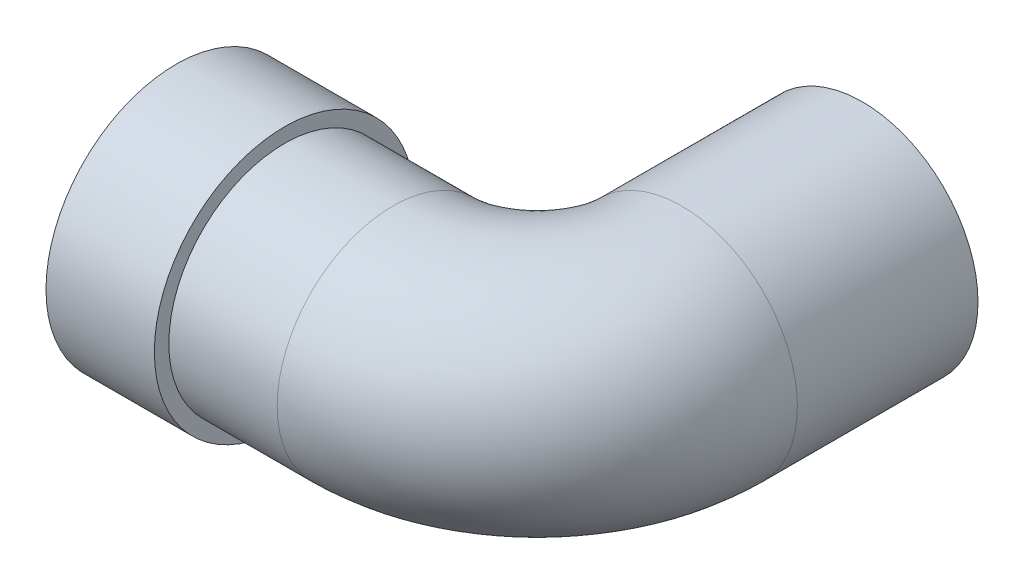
ISO-10303-21;
HEADER;
FILE_DESCRIPTION(('STEP AP214'),'2;1');
FILE_NAME('part.step','',(''),(''),'','','');
FILE_SCHEMA(('AUTOMOTIVE_DESIGN { 1 0 10303 214 1 1 1 1 }'));
ENDSEC;
DATA;
#1=APPLICATION_CONTEXT('core data for automotive mechanical design processes');
#2=APPLICATION_PROTOCOL_DEFINITION('international standard','automotive_design',2000,#1);
#3=PRODUCT_CONTEXT('',#1,'mechanical');
#4=PRODUCT('Part','Part','',(#3));
#5=PRODUCT_RELATED_PRODUCT_CATEGORY('part','',(#4));
#6=PRODUCT_DEFINITION_FORMATION('','',#4);
#7=PRODUCT_DEFINITION_CONTEXT('part definition',#1,'design');
#8=PRODUCT_DEFINITION('design','',#6,#7);
#9=PRODUCT_DEFINITION_SHAPE('','',#8);
#10=(LENGTH_UNIT() NAMED_UNIT(*) SI_UNIT(.MILLI.,.METRE.));
#11=(NAMED_UNIT(*) PLANE_ANGLE_UNIT() SI_UNIT($,.RADIAN.));
#12=(NAMED_UNIT(*) SI_UNIT($,.STERADIAN.) SOLID_ANGLE_UNIT());
#13=UNCERTAINTY_MEASURE_WITH_UNIT(LENGTH_MEASURE(1.E-05),#10,'distance_accuracy_value','');
#14=(GEOMETRIC_REPRESENTATION_CONTEXT(3) GLOBAL_UNCERTAINTY_ASSIGNED_CONTEXT((#13)) GLOBAL_UNIT_ASSIGNED_CONTEXT((#10,
#11,#12)) REPRESENTATION_CONTEXT('',''));
#15=CARTESIAN_POINT('',(0.,0.,0.));
#16=DIRECTION('',(0.,0.,1.));
#17=DIRECTION('',(1.,0.,0.));
#18=AXIS2_PLACEMENT_3D('',#15,#16,#17);
#19=CARTESIAN_POINT('',(-20.,0.,45.));
#20=DIRECTION('',(-1.,0.,0.));
#21=DIRECTION('',(0.,0.,1.));
#22=AXIS2_PLACEMENT_3D('',#19,#20,#21);
#23=CYLINDRICAL_SURFACE('',#22,16.);
#24=CARTESIAN_POINT('',(-20.,0.,45.));
#25=DIRECTION('',(-1.,0.,0.));
#26=DIRECTION('',(0.,0.,1.));
#27=AXIS2_PLACEMENT_3D('',#24,#25,#26);
#28=CIRCLE('',#27,16.);
#29=CARTESIAN_POINT('',(-20.,0.,61.));
#30=VERTEX_POINT('',#29);
#31=EDGE_CURVE('E40',#30,#30,#28,.T.);
#32=ORIENTED_EDGE('',*,*,#31,.T.);
#33=EDGE_LOOP('',(#32));
#34=FACE_BOUND('',#33,.T.);
#35=CARTESIAN_POINT('',(-35.,0.,45.));
#36=DIRECTION('',(-1.,0.,0.));
#37=DIRECTION('',(0.,0.,1.));
#38=AXIS2_PLACEMENT_3D('',#35,#36,#37);
#39=CIRCLE('',#38,16.);
#40=CARTESIAN_POINT('',(-35.,0.,61.));
#41=VERTEX_POINT('',#40);
#42=EDGE_CURVE('E68',#41,#41,#39,.T.);
#43=ORIENTED_EDGE('',*,*,#42,.F.);
#44=EDGE_LOOP('',(#43));
#45=FACE_BOUND('',#44,.T.);
#46=ADVANCED_FACE('F37',(#34,#45),#23,.T.);
#47=CARTESIAN_POINT('',(0.,0.,0.));
#48=DIRECTION('',(0.,0.,1.));
#49=DIRECTION('',(1.,0.,0.));
#50=AXIS2_PLACEMENT_3D('',#47,#48,#49);
#51=CYLINDRICAL_SURFACE('',#50,16.);
#52=CARTESIAN_POINT('',(0.,0.,25.));
#53=DIRECTION('',(0.,0.,1.));
#54=DIRECTION('',(1.,0.,0.));
#55=AXIS2_PLACEMENT_3D('',#52,#53,#54);
#56=CIRCLE('',#55,16.);
#57=CARTESIAN_POINT('',(16.,0.,25.));
#58=VERTEX_POINT('',#57);
#59=EDGE_CURVE('E56',#58,#58,#56,.T.);
#60=ORIENTED_EDGE('',*,*,#59,.F.);
#61=EDGE_LOOP('',(#60));
#62=FACE_BOUND('',#61,.T.);
#63=CARTESIAN_POINT('',(0.,0.,0.));
#64=DIRECTION('',(0.,0.,1.));
#65=DIRECTION('',(1.,0.,0.));
#66=AXIS2_PLACEMENT_3D('',#63,#64,#65);
#67=CIRCLE('',#66,16.);
#68=CARTESIAN_POINT('',(16.,0.,0.));
#69=VERTEX_POINT('',#68);
#70=EDGE_CURVE('E53',#69,#69,#67,.T.);
#71=ORIENTED_EDGE('',*,*,#70,.T.);
#72=EDGE_LOOP('',(#71));
#73=FACE_BOUND('',#72,.T.);
#74=ADVANCED_FACE('F92',(#62,#73),#51,.T.);
#75=CARTESIAN_POINT('',(-20.,0.,25.));
#76=DIRECTION('',(0.,-1.,0.));
#77=DIRECTION('',(0.,0.,-1.));
#78=AXIS2_PLACEMENT_3D('',#75,#76,#77);
#79=TOROIDAL_SURFACE('',#78,20.,16.);
#80=CARTESIAN_POINT('',(-20.,0.,25.));
#81=DIRECTION('',(0.,-1.,0.));
#82=DIRECTION('',(0.,0.,-1.));
#83=AXIS2_PLACEMENT_3D('',#80,#81,#82);
#84=CIRCLE('',#83,36.);
#85=EDGE_CURVE('',#58,#30,#84,.T.);
#86=ORIENTED_EDGE('',*,*,#59,.T.);
#87=ORIENTED_EDGE('',*,*,#31,.F.);
#88=ORIENTED_EDGE('',*,*,#85,.T.);
#89=ORIENTED_EDGE('',*,*,#85,.F.);
#90=EDGE_LOOP('',(#86,#88,#87,#89));
#91=FACE_BOUND('',#90,.T.);
#92=ADVANCED_FACE('F88',(#91),#79,.T.);
#93=CARTESIAN_POINT('',(0.,0.,0.));
#94=DIRECTION('',(0.,0.,1.));
#95=DIRECTION('',(1.,0.,0.));
#96=AXIS2_PLACEMENT_3D('',#93,#94,#95);
#97=PLANE('',#96);
#98=CARTESIAN_POINT('',(0.,0.,0.));
#99=DIRECTION('',(0.,0.,1.));
#100=DIRECTION('',(1.,0.,0.));
#101=AXIS2_PLACEMENT_3D('',#98,#99,#100);
#102=CIRCLE('',#101,14.);
#103=CARTESIAN_POINT('',(14.,0.,0.));
#104=VERTEX_POINT('',#103);
#105=EDGE_CURVE('E55',#104,#104,#102,.F.);
#106=ORIENTED_EDGE('',*,*,#105,.F.);
#107=EDGE_LOOP('',(#106));
#108=FACE_BOUND('',#107,.T.);
#109=ORIENTED_EDGE('',*,*,#70,.F.);
#110=EDGE_LOOP('',(#109));
#111=FACE_BOUND('',#110,.T.);
#112=ADVANCED_FACE('F85',(#108,#111),#97,.F.);
#113=CARTESIAN_POINT('',(-40.,0.,45.));
#114=DIRECTION('',(-1.,0.,0.));
#115=DIRECTION('',(0.,0.,1.));
#116=AXIS2_PLACEMENT_3D('',#113,#114,#115);
#117=PLANE('',#116);
#118=CARTESIAN_POINT('',(-40.,0.,45.));
#119=DIRECTION('',(-1.,0.,0.));
#120=DIRECTION('',(0.,0.,1.));
#121=AXIS2_PLACEMENT_3D('',#118,#119,#120);
#122=CIRCLE('',#121,14.);
#123=CARTESIAN_POINT('',(-40.,0.,59.));
#124=VERTEX_POINT('',#123);
#125=EDGE_CURVE('E10',#124,#124,#122,.F.);
#126=ORIENTED_EDGE('',*,*,#125,.T.);
#127=EDGE_LOOP('',(#126));
#128=FACE_BOUND('',#127,.T.);
#129=CARTESIAN_POINT('',(-40.,0.,45.));
#130=DIRECTION('',(-1.,0.,0.));
#131=DIRECTION('',(0.,0.,1.));
#132=AXIS2_PLACEMENT_3D('',#129,#130,#131);
#133=CIRCLE('',#132,16.);
#134=CARTESIAN_POINT('',(-40.,0.,61.));
#135=VERTEX_POINT('',#134);
#136=EDGE_CURVE('E58',#135,#135,#133,.T.);
#137=ORIENTED_EDGE('',*,*,#136,.T.);
#138=EDGE_LOOP('',(#137));
#139=FACE_BOUND('',#138,.T.);
#140=ADVANCED_FACE('F81',(#128,#139),#117,.T.);
#141=CARTESIAN_POINT('',(0.,0.,0.));
#142=DIRECTION('',(0.,0.,1.));
#143=DIRECTION('',(1.,0.,0.));
#144=AXIS2_PLACEMENT_3D('',#141,#142,#143);
#145=CYLINDRICAL_SURFACE('',#144,14.);
#146=CARTESIAN_POINT('',(0.,0.,25.));
#147=DIRECTION('',(0.,0.,1.));
#148=DIRECTION('',(1.,0.,0.));
#149=AXIS2_PLACEMENT_3D('',#146,#147,#148);
#150=CIRCLE('',#149,14.);
#151=CARTESIAN_POINT('',(14.,0.,25.));
#152=VERTEX_POINT('',#151);
#153=EDGE_CURVE('E49',#152,#152,#150,.F.);
#154=ORIENTED_EDGE('',*,*,#153,.F.);
#155=EDGE_LOOP('',(#154));
#156=FACE_BOUND('',#155,.T.);
#157=ORIENTED_EDGE('',*,*,#105,.T.);
#158=EDGE_LOOP('',(#157));
#159=FACE_BOUND('',#158,.T.);
#160=ADVANCED_FACE('F78',(#156,#159),#145,.F.);
#161=CARTESIAN_POINT('',(-20.,0.,25.));
#162=DIRECTION('',(0.,-1.,0.));
#163=DIRECTION('',(0.,0.,-1.));
#164=AXIS2_PLACEMENT_3D('',#161,#162,#163);
#165=TOROIDAL_SURFACE('',#164,20.,14.);
#166=CARTESIAN_POINT('',(-20.,0.,45.));
#167=DIRECTION('',(-1.,0.,0.));
#168=DIRECTION('',(0.,0.,1.));
#169=AXIS2_PLACEMENT_3D('',#166,#167,#168);
#170=CIRCLE('',#169,14.);
#171=CARTESIAN_POINT('',(-20.,0.,59.));
#172=VERTEX_POINT('',#171);
#173=EDGE_CURVE('E44',#172,#172,#170,.F.);
#174=CARTESIAN_POINT('',(-20.,0.,25.));
#175=DIRECTION('',(0.,-1.,0.));
#176=DIRECTION('',(0.,0.,-1.));
#177=AXIS2_PLACEMENT_3D('',#174,#175,#176);
#178=CIRCLE('',#177,34.);
#179=EDGE_CURVE('',#152,#172,#178,.T.);
#180=ORIENTED_EDGE('',*,*,#153,.T.);
#181=ORIENTED_EDGE('',*,*,#173,.F.);
#182=ORIENTED_EDGE('',*,*,#179,.T.);
#183=ORIENTED_EDGE('',*,*,#179,.F.);
#184=EDGE_LOOP('',(#180,#182,#181,#183));
#185=FACE_BOUND('',#184,.T.);
#186=ADVANCED_FACE('F76',(#185),#165,.F.);
#187=CARTESIAN_POINT('',(-20.,0.,45.));
#188=DIRECTION('',(-1.,0.,0.));
#189=DIRECTION('',(0.,0.,1.));
#190=AXIS2_PLACEMENT_3D('',#187,#188,#189);
#191=CYLINDRICAL_SURFACE('',#190,14.);
#192=ORIENTED_EDGE('',*,*,#125,.F.);
#193=EDGE_LOOP('',(#192));
#194=FACE_BOUND('',#193,.T.);
#195=ORIENTED_EDGE('',*,*,#173,.T.);
#196=EDGE_LOOP('',(#195));
#197=FACE_BOUND('',#196,.T.);
#198=ADVANCED_FACE('F103',(#194,#197),#191,.F.);
#199=CARTESIAN_POINT('',(-35.,0.,45.));
#200=DIRECTION('',(-1.,0.,0.));
#201=DIRECTION('',(0.,0.,1.));
#202=AXIS2_PLACEMENT_3D('',#199,#200,#201);
#203=CYLINDRICAL_SURFACE('',#202,18.);
#204=CARTESIAN_POINT('',(-35.,0.,45.));
#205=DIRECTION('',(-1.,0.,0.));
#206=DIRECTION('',(0.,0.,1.));
#207=AXIS2_PLACEMENT_3D('',#204,#205,#206);
#208=CIRCLE('',#207,18.);
#209=CARTESIAN_POINT('',(-35.,0.,63.));
#210=VERTEX_POINT('',#209);
#211=EDGE_CURVE('E63',#210,#210,#208,.T.);
#212=ORIENTED_EDGE('',*,*,#211,.T.);
#213=EDGE_LOOP('',(#212));
#214=FACE_BOUND('',#213,.T.);
#215=CARTESIAN_POINT('',(-50.,0.,45.));
#216=DIRECTION('',(-1.,0.,0.));
#217=DIRECTION('',(0.,0.,1.));
#218=AXIS2_PLACEMENT_3D('',#215,#216,#217);
#219=CIRCLE('',#218,18.);
#220=CARTESIAN_POINT('',(-50.,0.,63.));
#221=VERTEX_POINT('',#220);
#222=EDGE_CURVE('E184',#221,#221,#219,.T.);
#223=ORIENTED_EDGE('',*,*,#222,.F.);
#224=EDGE_LOOP('',(#223));
#225=FACE_BOUND('',#224,.T.);
#226=ADVANCED_FACE('F96',(#214,#225),#203,.T.);
#227=CARTESIAN_POINT('',(-35.,0.,45.));
#228=DIRECTION('',(-1.,0.,0.));
#229=DIRECTION('',(0.,0.,1.));
#230=AXIS2_PLACEMENT_3D('',#227,#228,#229);
#231=PLANE('',#230);
#232=ORIENTED_EDGE('',*,*,#42,.T.);
#233=EDGE_LOOP('',(#232));
#234=FACE_BOUND('',#233,.T.);
#235=ORIENTED_EDGE('',*,*,#211,.F.);
#236=EDGE_LOOP('',(#235));
#237=FACE_BOUND('',#236,.T.);
#238=ADVANCED_FACE('F105',(#234,#237),#231,.F.);
#239=CARTESIAN_POINT('',(-35.,0.,45.));
#240=DIRECTION('',(-1.,0.,0.));
#241=DIRECTION('',(0.,0.,1.));
#242=AXIS2_PLACEMENT_3D('',#239,#240,#241);
#243=CYLINDRICAL_SURFACE('',#242,16.);
#244=ORIENTED_EDGE('',*,*,#136,.F.);
#245=EDGE_LOOP('',(#244));
#246=FACE_BOUND('',#245,.T.);
#247=CARTESIAN_POINT('',(-50.,0.,45.));
#248=DIRECTION('',(-1.,0.,0.));
#249=DIRECTION('',(0.,0.,1.));
#250=AXIS2_PLACEMENT_3D('',#247,#248,#249);
#251=CIRCLE('',#250,16.);
#252=CARTESIAN_POINT('',(-50.,0.,61.));
#253=VERTEX_POINT('',#252);
#254=EDGE_CURVE('E187',#253,#253,#251,.T.);
#255=ORIENTED_EDGE('',*,*,#254,.T.);
#256=EDGE_LOOP('',(#255));
#257=FACE_BOUND('',#256,.T.);
#258=ADVANCED_FACE('F111',(#246,#257),#243,.F.);
#259=CARTESIAN_POINT('',(-50.,0.,45.));
#260=DIRECTION('',(-1.,0.,0.));
#261=DIRECTION('',(0.,0.,1.));
#262=AXIS2_PLACEMENT_3D('',#259,#260,#261);
#263=PLANE('',#262);
#264=ORIENTED_EDGE('',*,*,#222,.T.);
#265=EDGE_LOOP('',(#264));
#266=FACE_BOUND('',#265,.T.);
#267=ORIENTED_EDGE('',*,*,#254,.F.);
#268=EDGE_LOOP('',(#267));
#269=FACE_BOUND('',#268,.T.);
#270=ADVANCED_FACE('F167',(#266,#269),#263,.T.);
#271=CLOSED_SHELL('',(#46,#74,#92,#112,#140,#160,#186,#198,#226,#238,#258,#270));
#272=MANIFOLD_SOLID_BREP('B2',#271);
#273=ADVANCED_BREP_SHAPE_REPRESENTATION('',(#18,#272),#14);
#274=SHAPE_DEFINITION_REPRESENTATION(#9,#273);
ENDSEC;
END-ISO-10303-21;
